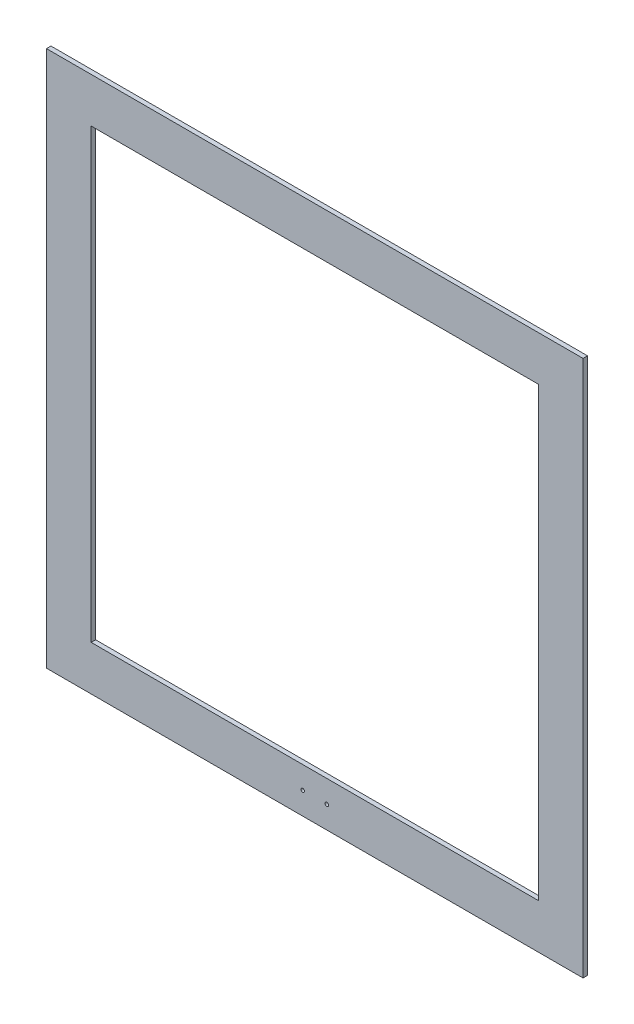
from build123d import *

# Parameters (mm, degrees)
ESQUISSE1_W             = 600
ESQUISSE1_H             = 600
ESQUISSE1_W_2           = 500
ESQUISSE1_H_2           = 500
BOSS_EXTRU_1_DEPTH      = 5
ENL_V_MAT_EXTRU_1_REACH = 426.294
ESQUISSE2_R             = 2


with BuildPart() as part:
    # Esquisse1 → Boss.-Extru.1 (new body)
    with BuildSketch(Plane.XY):
        Rectangle(ESQUISSE1_W, ESQUISSE1_H)
        Rectangle(ESQUISSE1_W_2, ESQUISSE1_H_2, mode=Mode.SUBTRACT)
    extrude(amount=BOSS_EXTRU_1_DEPTH)

    # Esquisse2 → Enl_v. mat.-Extru.1 (cut, up to next)
    with BuildSketch(Plane.XY.offset(5), mode=Mode.PRIVATE) as enl_v_mat_extru_1_sk1:
        with Locations((-13.5, -275)):
            Circle(ESQUISSE2_R)
    enl_v_mat_extru_1_tool1 = extrude(enl_v_mat_extru_1_sk1.sketch, amount=-ENL_V_MAT_EXTRU_1_REACH, mode=Mode.PRIVATE) & part.part
    # Esquisse2 → Enl_v. mat.-Extru.1 (cut, up to next)
    with BuildSketch(Plane.XY.offset(5), mode=Mode.PRIVATE) as enl_v_mat_extru_1_sk2:
        with Locations((13.5, -275)):
            Circle(ESQUISSE2_R)
    enl_v_mat_extru_1_tool2 = extrude(enl_v_mat_extru_1_sk2.sketch, amount=-ENL_V_MAT_EXTRU_1_REACH, mode=Mode.PRIVATE) & part.part
    add(enl_v_mat_extru_1_tool1.solids().sort_by_distance((-13.5, -275, 5))[0], mode=Mode.SUBTRACT)
    add(enl_v_mat_extru_1_tool2.solids().sort_by_distance((13.5, -275, 5))[0], mode=Mode.SUBTRACT)


solid = part.part
